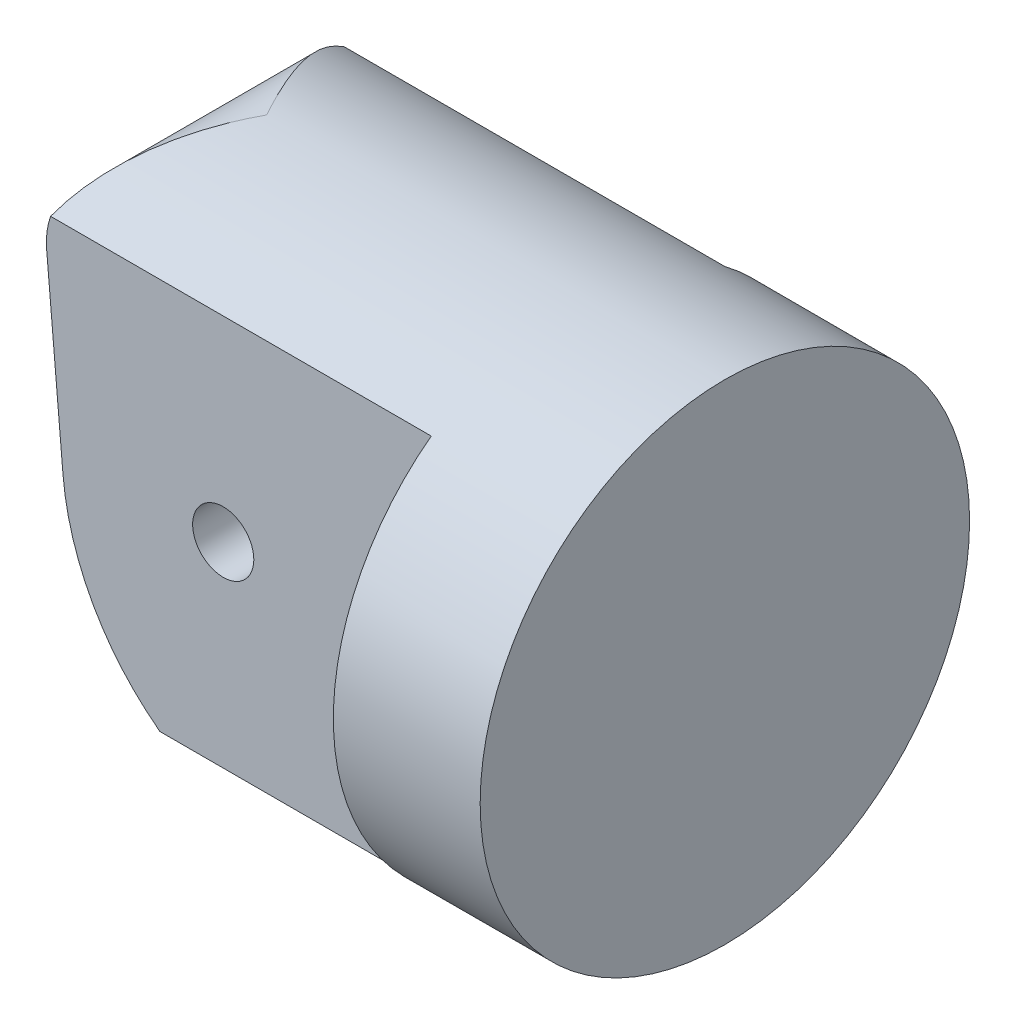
from build123d import *

# Parameters (mm, degrees)
BOSS_EXTRU_1_START           = -4
ESQUISSE1_R                  = 10
BOSS_EXTRU_1_DEPTH           = 22
ENL_V_MAT_EXTRU_1_DEPTH      = 30.597297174
ENL_V_MAT_EXTRU_1_DEPTH_BACK = 30.597297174
ESQUISSE3_W                  = 16
ESQUISSE3_H                  = 4
ENL_V_MAT_EXTRU_2_DEPTH      = 30.597297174
ENL_V_MAT_EXTRU_2_DEPTH_BACK = 30.597297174
ESQUISSE4_R                  = 1.25
ENL_V_MAT_EXTRU_3_DEPTH      = 30.597297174
ENL_V_MAT_EXTRU_3_DEPTH_BACK = 30.597297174
ESQUISSE5_OUTSIDE_W          = 31.166
ESQUISSE5_OUTSIDE_H          = 29.166
ESQUISSE10_W                 = 6
ESQUISSE10_H                 = 14
ENL_V_MAT_EXTRU_6_DEPTH      = 12


with BuildPart() as part:
    # Esquisse1 → Boss.-Extru.1 (new body)
    with BuildSketch(Plane(origin=(0, 0, 0), x_dir=(0, 0, -1), z_dir=(1, 0, 0)).offset(BOSS_EXTRU_1_START)):
        Circle(ESQUISSE1_R)
    extrude(amount=-BOSS_EXTRU_1_DEPTH)

    # Esquisse3 → Enl_v. mat.-Extru.1 (cut, two sides: drawn at the far end of the back side and taken through both)
    with BuildSketch(Plane(origin=(0, 0, 0), x_dir=(1, 0, 0), z_dir=(0, 1, 0)).offset(-ENL_V_MAT_EXTRU_1_DEPTH_BACK)):
        with Locations((-18, -8)):
            Rectangle(ESQUISSE3_W, ESQUISSE3_H)
        with Locations((-18, 8)):
            Rectangle(ESQUISSE3_W, ESQUISSE3_H)
    extrude(amount=ENL_V_MAT_EXTRU_1_DEPTH + ENL_V_MAT_EXTRU_1_DEPTH_BACK, mode=Mode.SUBTRACT)

    # Esquisse4 → Enl_v. mat.-Extru.2 (cut, two sides: drawn at the far end of the back side and taken through both)
    with BuildSketch(Plane.XY.offset(-ENL_V_MAT_EXTRU_2_DEPTH_BACK)):
        with Locations((-18.5, 0)):
            Circle(ESQUISSE4_R)
    extrude(amount=ENL_V_MAT_EXTRU_2_DEPTH + ENL_V_MAT_EXTRU_2_DEPTH_BACK, mode=Mode.SUBTRACT)

    # Esquisse5 outside → Enl_v. mat.-Extru.3 (cut, two sides: drawn at the far end of the back side and taken through both)
    with BuildSketch(Plane.XY.offset(-ENL_V_MAT_EXTRU_3_DEPTH_BACK)):
        with Locations((-15, 0)):
            Rectangle(ESQUISSE5_OUTSIDE_W, ESQUISSE5_OUTSIDE_H)
        with BuildLine():
            Line((-25.714658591, 6.738532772), (-25.04886197, -0.871557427))
            ThreePointArc((-25.04886197, -0.871557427), (-21.842817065, -7.372773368), (-15.086914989, -10))
            Line((-15.086914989, -10), (-4, -10))
            Line((-4, -10), (-4, 10))
            Line((-4, 10), (-22.726074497, 10))
            ThreePointArc((-22.726074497, 10), (-24.937906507, 9.026770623), (-25.714658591, 6.738532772))
        make_face(mode=Mode.SUBTRACT)
    extrude(amount=ENL_V_MAT_EXTRU_3_DEPTH + ENL_V_MAT_EXTRU_3_DEPTH_BACK, mode=Mode.SUBTRACT)

    # Esquisse10 → Enl_v. mat.-Extru.6 (cut)
    with BuildSketch(Plane(origin=(-24.934259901, -2.181465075, 0), x_dir=(0, 0, 1), z_dir=(-0.9961946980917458, -0.08715574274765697, 0))):
        with Locations((0, 1.954070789)):
            Rectangle(ESQUISSE10_W, ESQUISSE10_H)
    extrude(amount=-ENL_V_MAT_EXTRU_6_DEPTH, mode=Mode.SUBTRACT)


solid = part.part
